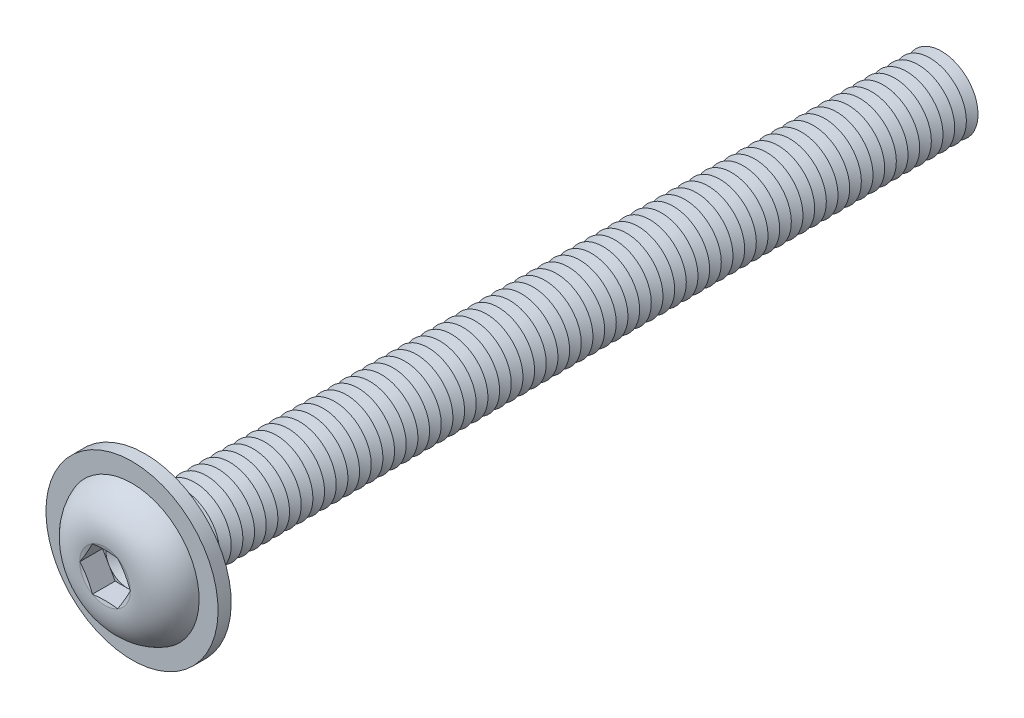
from build123d import *

# Parameters (mm, degrees)
FILLET1_R           = 0.4
LPATTERN1_COUNT     = 68
LPATTERN1_PITCH     = 0.8
CUT_EXTRUDE1_DEPTH  = 1.56
SKETCH5_R           = 5.9
SKETCH5_R_2         = 2.9
BOSS_EXTRUDE1_DEPTH = 0.9


with BuildPart() as part:
    # Sketch1 → Revolve1 (revolve)
    with BuildSketch(Plane(origin=(0, 0, 0), x_dir=(0, 0, -1), z_dir=(1, 0, 0))):
        with BuildLine():
            Line((0, 2.5), (0, 4.75))
            ThreePointArc((0, 4.75), (-2.041477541, 3.848329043), (-2.75, 1.73205))
            Line((-2.75, 1.73205), (-2.517949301, 0.866025))
            Line((-2.517949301, 0.866025), (-2.75, 0.866025))
            Line((-2.75, 0.866025), (-2.75, 0))
            Line((-2.75, 0), (55, 0))
            Line((55, 0), (55, 2.5))
            Line((55, 2.5), (0, 2.5))
        make_face()
    revolve(axis=Axis((0, 0, -55), (0, 0, 1)))

    # Fillet1
    fillet1_edges = [part.edges().sort_by_distance(p)[0] for p in [
        (0, -2.5, 0),
    ]]
    fillet(fillet1_edges, radius=FILLET1_R)

    # Sketch2 → Cut-Revolve1 (revolve, cut)
    with BuildSketch(Plane(origin=(0, 0, 0), x_dir=(0, 0, -1), z_dir=(1, 0, 0))):
        Polygon((54.6, 2.5), (55.4, 2.5), (55, 1.807179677), align=None)
    cut_revolve1 = revolve(axis=Axis((0, 0, -55), (0, 0, -1)), mode=Mode.SUBTRACT)

    # LPattern1: Cut-Revolve1 ×68
    with Locations(*[(0, 0, i * LPATTERN1_PITCH) for i in range(1, LPATTERN1_COUNT)]):
        add(cut_revolve1, mode=Mode.SUBTRACT)

    # Sketch3 → Cut-Extrude1 (cut)
    with BuildSketch(Plane.XY.offset(2.75)):
        Polygon((0.866025, 1.499999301), (-0.866025, 1.499999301), (-1.73205, 0), (-0.866025, -1.499999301), (0.866025, -1.499999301), (1.73205, 0), align=None)
    extrude(amount=-CUT_EXTRUDE1_DEPTH, mode=Mode.SUBTRACT)

    # Cut-Extrude2 cone 1 section (on through the dimple's axis) → Cut-Extrude2 (revolve, cut)
    with BuildSketch(Plane(origin=(0, 0, 1.19), x_dir=(0, -1, 0), z_dir=(1, 0, 0))):
        Polygon((0, 0), (1.499999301, 0), (0, 0.866025), align=None)
    revolve(axis=Axis((0, 0, 1.19), (0, 0, -1)), mode=Mode.SUBTRACT)

    # Sketch5 → Boss-Extrude1 (add)
    with BuildSketch(Plane(origin=(0, 0, 0), x_dir=(-1, 0, 0), z_dir=(0, 0, -1))):
        with Locations(Location((0, 0, 0), (0, 0, 90))):
            Circle(SKETCH5_R)
        Circle(SKETCH5_R_2, mode=Mode.SUBTRACT)
    extrude(amount=-BOSS_EXTRUDE1_DEPTH)


solid = part.part
